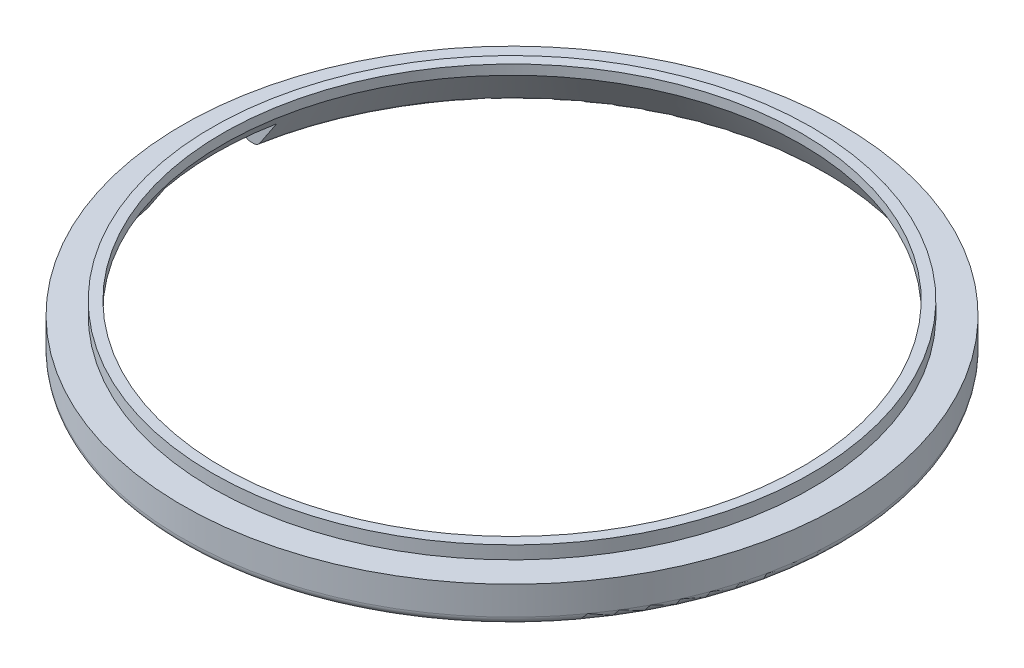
ISO-10303-21;
HEADER;
FILE_DESCRIPTION(('STEP AP214'),'2;1');
FILE_NAME('part.step','',(''),(''),'','','');
FILE_SCHEMA(('AUTOMOTIVE_DESIGN { 1 0 10303 214 1 1 1 1 }'));
ENDSEC;
DATA;
#1=APPLICATION_CONTEXT('core data for automotive mechanical design processes');
#2=APPLICATION_PROTOCOL_DEFINITION('international standard','automotive_design',2000,#1);
#3=PRODUCT_CONTEXT('',#1,'mechanical');
#4=PRODUCT('Part','Part','',(#3));
#5=PRODUCT_RELATED_PRODUCT_CATEGORY('part','',(#4));
#6=PRODUCT_DEFINITION_FORMATION('','',#4);
#7=PRODUCT_DEFINITION_CONTEXT('part definition',#1,'design');
#8=PRODUCT_DEFINITION('design','',#6,#7);
#9=PRODUCT_DEFINITION_SHAPE('','',#8);
#10=(LENGTH_UNIT() NAMED_UNIT(*) SI_UNIT(.MILLI.,.METRE.));
#11=(NAMED_UNIT(*) PLANE_ANGLE_UNIT() SI_UNIT($,.RADIAN.));
#12=(NAMED_UNIT(*) SI_UNIT($,.STERADIAN.) SOLID_ANGLE_UNIT());
#13=UNCERTAINTY_MEASURE_WITH_UNIT(LENGTH_MEASURE(1.E-05),#10,'distance_accuracy_value','');
#14=(GEOMETRIC_REPRESENTATION_CONTEXT(3) GLOBAL_UNCERTAINTY_ASSIGNED_CONTEXT((#13)) GLOBAL_UNIT_ASSIGNED_CONTEXT((#10,
#11,#12)) REPRESENTATION_CONTEXT('',''));
#15=CARTESIAN_POINT('',(0.,0.,0.));
#16=DIRECTION('',(0.,0.,1.));
#17=DIRECTION('',(1.,0.,0.));
#18=AXIS2_PLACEMENT_3D('',#15,#16,#17);
#19=CARTESIAN_POINT('',(0.,1.9,0.));
#20=DIRECTION('',(0.,1.,0.));
#21=DIRECTION('',(0.,0.,1.));
#22=AXIS2_PLACEMENT_3D('',#19,#20,#21);
#23=PLANE('',#22);
#24=CARTESIAN_POINT('',(0.,1.9,0.));
#25=DIRECTION('',(0.,1.,0.));
#26=DIRECTION('',(0.,0.,1.));
#27=AXIS2_PLACEMENT_3D('',#24,#25,#26);
#28=CIRCLE('',#27,11.15);
#29=CARTESIAN_POINT('',(0.,1.9,-11.15));
#30=VERTEX_POINT('',#29);
#31=EDGE_CURVE('E236',#30,#30,#28,.T.);
#32=ORIENTED_EDGE('',*,*,#31,.F.);
#33=EDGE_LOOP('',(#32));
#34=FACE_BOUND('',#33,.T.);
#35=CARTESIAN_POINT('',(0.,1.9,0.));
#36=DIRECTION('',(0.,1.,0.));
#37=DIRECTION('',(0.,0.,1.));
#38=AXIS2_PLACEMENT_3D('',#35,#36,#37);
#39=CIRCLE('',#38,11.55);
#40=CARTESIAN_POINT('',(0.,1.9,11.55));
#41=VERTEX_POINT('',#40);
#42=EDGE_CURVE('E251',#41,#41,#39,.T.);
#43=ORIENTED_EDGE('',*,*,#42,.T.);
#44=EDGE_LOOP('',(#43));
#45=FACE_BOUND('',#44,.T.);
#46=ADVANCED_FACE('F34',(#34,#45),#23,.T.);
#47=CARTESIAN_POINT('',(0.,1.9,0.));
#48=DIRECTION('',(0.,-1.,0.));
#49=DIRECTION('',(0.,0.,-1.));
#50=AXIS2_PLACEMENT_3D('',#47,#48,#49);
#51=CYLINDRICAL_SURFACE('',#50,12.7);
#52=CARTESIAN_POINT('',(0.,1.4,0.));
#53=DIRECTION('',(0.,1.,0.));
#54=DIRECTION('',(0.,0.,1.));
#55=AXIS2_PLACEMENT_3D('',#52,#53,#54);
#56=CIRCLE('',#55,12.7);
#57=CARTESIAN_POINT('',(-12.516688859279,1.4,2.15));
#58=VERTEX_POINT('',#57);
#59=CARTESIAN_POINT('',(-12.516688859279,1.4,-2.15));
#60=VERTEX_POINT('',#59);
#61=EDGE_CURVE('E102',#58,#60,#56,.T.);
#62=ORIENTED_EDGE('',*,*,#61,.F.);
#63=DIRECTION('',(0.,-1.,0.));
#64=VECTOR('',#63,1.);
#65=CARTESIAN_POINT('',(-12.516688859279,1.9,2.15));
#66=LINE('',#65,#64);
#67=CARTESIAN_POINT('',(-12.516688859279,0.3,2.15));
#68=VERTEX_POINT('',#67);
#69=EDGE_CURVE('E115',#58,#68,#66,.T.);
#70=ORIENTED_EDGE('',*,*,#69,.T.);
#71=CARTESIAN_POINT('',(0.,0.3,0.));
#72=DIRECTION('',(0.,1.,0.));
#73=DIRECTION('',(0.,0.,1.));
#74=AXIS2_PLACEMENT_3D('',#71,#72,#73);
#75=CIRCLE('',#74,12.7);
#76=CARTESIAN_POINT('',(-12.516688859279,0.3,-2.15));
#77=VERTEX_POINT('',#76);
#78=EDGE_CURVE('E108',#68,#77,#75,.T.);
#79=ORIENTED_EDGE('',*,*,#78,.T.);
#80=DIRECTION('',(0.,-1.,0.));
#81=VECTOR('',#80,1.);
#82=CARTESIAN_POINT('',(-12.516688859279,1.9,-2.15));
#83=LINE('',#82,#81);
#84=EDGE_CURVE('E118',#77,#60,#83,.F.);
#85=ORIENTED_EDGE('',*,*,#84,.T.);
#86=EDGE_LOOP('',(#62,#70,#79,#85));
#87=FACE_BOUND('',#86,.T.);
#88=ADVANCED_FACE('F113',(#87),#51,.T.);
#89=CARTESIAN_POINT('',(0.,0.,0.));
#90=DIRECTION('',(0.,1.,0.));
#91=DIRECTION('',(0.,0.,1.));
#92=AXIS2_PLACEMENT_3D('',#89,#90,#91);
#93=PLANE('',#92);
#94=DIRECTION('',(1.,0.,0.));
#95=VECTOR('',#94,1.);
#96=CARTESIAN_POINT('',(-12.7,0.,-2.15));
#97=LINE('',#96,#95);
#98=CARTESIAN_POINT('',(-12.212186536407,0.,-2.15));
#99=VERTEX_POINT('',#98);
#100=CARTESIAN_POINT('',(-12.1228641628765,0.,-2.15));
#101=VERTEX_POINT('',#100);
#102=EDGE_CURVE('E126',#99,#101,#97,.T.);
#103=ORIENTED_EDGE('',*,*,#102,.F.);
#104=CARTESIAN_POINT('',(0.,0.,0.));
#105=DIRECTION('',(0.,1.,0.));
#106=DIRECTION('',(0.,0.,1.));
#107=AXIS2_PLACEMENT_3D('',#104,#105,#106);
#108=CIRCLE('',#107,12.4);
#109=CARTESIAN_POINT('',(-12.212186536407,0.,2.15));
#110=VERTEX_POINT('',#109);
#111=EDGE_CURVE('E166',#99,#110,#108,.F.);
#112=ORIENTED_EDGE('',*,*,#111,.T.);
#113=DIRECTION('',(1.,0.,0.));
#114=VECTOR('',#113,1.);
#115=CARTESIAN_POINT('',(-12.7,0.,2.15));
#116=LINE('',#115,#114);
#117=CARTESIAN_POINT('',(-12.1228641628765,0.,2.15));
#118=VERTEX_POINT('',#117);
#119=EDGE_CURVE('E232',#110,#118,#116,.T.);
#120=ORIENTED_EDGE('',*,*,#119,.T.);
#121=CARTESIAN_POINT('',(0.,0.,0.));
#122=DIRECTION('',(0.,1.,0.));
#123=DIRECTION('',(0.,0.,1.));
#124=AXIS2_PLACEMENT_3D('',#121,#122,#123);
#125=CIRCLE('',#124,12.312040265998);
#126=EDGE_CURVE('E167',#118,#101,#125,.T.);
#127=ORIENTED_EDGE('',*,*,#126,.T.);
#128=EDGE_LOOP('',(#103,#112,#120,#127));
#129=FACE_BOUND('',#128,.T.);
#130=ADVANCED_FACE('F223',(#129),#93,.F.);
#131=CARTESIAN_POINT('',(0.,1.9,0.));
#132=DIRECTION('',(0.,-1.,0.));
#133=DIRECTION('',(0.,0.,-1.));
#134=AXIS2_PLACEMENT_3D('',#131,#132,#133);
#135=CYLINDRICAL_SURFACE('',#134,11.15);
#136=CARTESIAN_POINT('',(0.,1.52525347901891,0.));
#137=DIRECTION('',(0.,-1.,0.));
#138=DIRECTION('',(0.,0.,-1.));
#139=AXIS2_PLACEMENT_3D('',#136,#137,#138);
#140=CIRCLE('',#139,11.15);
#141=CARTESIAN_POINT('',(0.,1.52525347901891,-11.15));
#142=VERTEX_POINT('',#141);
#143=EDGE_CURVE('E119',#142,#142,#140,.T.);
#144=CARTESIAN_POINT('',(0.,1.52525347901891,-11.15));
#145=CARTESIAN_POINT('',(0.,1.52915708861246,-11.15));
#146=CARTESIAN_POINT('',(0.,1.53306069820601,-11.15));
#147=CARTESIAN_POINT('',(0.,1.54086791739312,-11.15));
#148=CARTESIAN_POINT('',(0.,1.54477152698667,-11.15));
#149=CARTESIAN_POINT('',(0.,1.55257874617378,-11.15));
#150=CARTESIAN_POINT('',(0.,1.55648235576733,-11.15));
#151=CARTESIAN_POINT('',(0.,1.56428957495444,-11.15));
#152=CARTESIAN_POINT('',(0.,1.56819318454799,-11.15));
#153=CARTESIAN_POINT('',(0.,1.5760004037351,-11.15));
#154=CARTESIAN_POINT('',(0.,1.57990401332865,-11.15));
#155=CARTESIAN_POINT('',(0.,1.58771123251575,-11.15));
#156=CARTESIAN_POINT('',(0.,1.59161484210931,-11.15));
#157=CARTESIAN_POINT('',(0.,1.59942206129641,-11.15));
#158=CARTESIAN_POINT('',(0.,1.60332567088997,-11.15));
#159=CARTESIAN_POINT('',(0.,1.61113289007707,-11.15));
#160=CARTESIAN_POINT('',(0.,1.61503649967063,-11.15));
#161=CARTESIAN_POINT('',(0.,1.62284371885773,-11.15));
#162=CARTESIAN_POINT('',(0.,1.62674732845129,-11.15));
#163=CARTESIAN_POINT('',(0.,1.63455454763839,-11.15));
#164=CARTESIAN_POINT('',(0.,1.63845815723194,-11.15));
#165=CARTESIAN_POINT('',(0.,1.64626537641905,-11.15));
#166=CARTESIAN_POINT('',(0.,1.6501689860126,-11.15));
#167=CARTESIAN_POINT('',(0.,1.65797620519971,-11.15));
#168=CARTESIAN_POINT('',(0.,1.66187981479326,-11.15));
#169=CARTESIAN_POINT('',(0.,1.66968703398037,-11.15));
#170=CARTESIAN_POINT('',(0.,1.67359064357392,-11.15));
#171=CARTESIAN_POINT('',(0.,1.68139786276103,-11.15));
#172=CARTESIAN_POINT('',(0.,1.68530147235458,-11.15));
#173=CARTESIAN_POINT('',(0.,1.69310869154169,-11.15));
#174=CARTESIAN_POINT('',(0.,1.69701230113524,-11.15));
#175=CARTESIAN_POINT('',(0.,1.70481952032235,-11.15));
#176=CARTESIAN_POINT('',(0.,1.7087231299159,-11.15));
#177=CARTESIAN_POINT('',(0.,1.71653034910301,-11.15));
#178=CARTESIAN_POINT('',(0.,1.72043395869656,-11.15));
#179=CARTESIAN_POINT('',(0.,1.72824117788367,-11.15));
#180=CARTESIAN_POINT('',(0.,1.73214478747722,-11.15));
#181=CARTESIAN_POINT('',(0.,1.73995200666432,-11.15));
#182=CARTESIAN_POINT('',(0.,1.74385561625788,-11.15));
#183=CARTESIAN_POINT('',(0.,1.75166283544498,-11.15));
#184=CARTESIAN_POINT('',(0.,1.75556644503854,-11.15));
#185=CARTESIAN_POINT('',(0.,1.76337366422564,-11.15));
#186=CARTESIAN_POINT('',(0.,1.7672772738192,-11.15));
#187=CARTESIAN_POINT('',(0.,1.7750844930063,-11.15));
#188=CARTESIAN_POINT('',(0.,1.77898810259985,-11.15));
#189=CARTESIAN_POINT('',(0.,1.78679532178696,-11.15));
#190=CARTESIAN_POINT('',(0.,1.79069893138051,-11.15));
#191=CARTESIAN_POINT('',(0.,1.79850615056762,-11.15));
#192=CARTESIAN_POINT('',(0.,1.80240976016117,-11.15));
#193=CARTESIAN_POINT('',(0.,1.81021697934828,-11.15));
#194=CARTESIAN_POINT('',(0.,1.81412058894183,-11.15));
#195=CARTESIAN_POINT('',(0.,1.82192780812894,-11.15));
#196=CARTESIAN_POINT('',(0.,1.82583141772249,-11.15));
#197=CARTESIAN_POINT('',(0.,1.8336386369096,-11.15));
#198=CARTESIAN_POINT('',(0.,1.83754224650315,-11.15));
#199=CARTESIAN_POINT('',(0.,1.84534946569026,-11.15));
#200=CARTESIAN_POINT('',(0.,1.84925307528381,-11.15));
#201=CARTESIAN_POINT('',(0.,1.85706029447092,-11.15));
#202=CARTESIAN_POINT('',(0.,1.86096390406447,-11.15));
#203=CARTESIAN_POINT('',(0.,1.86877112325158,-11.15));
#204=CARTESIAN_POINT('',(0.,1.87267473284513,-11.15));
#205=CARTESIAN_POINT('',(0.,1.88048195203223,-11.15));
#206=CARTESIAN_POINT('',(0.,1.88438556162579,-11.15));
#207=CARTESIAN_POINT('',(0.,1.89219278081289,-11.15));
#208=CARTESIAN_POINT('',(0.,1.89609639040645,-11.15));
#209=CARTESIAN_POINT('',(0.,1.9,-11.15));
#210=B_SPLINE_CURVE_WITH_KNOTS('',3,(#144,#145,#146,#147,#148,#149,#150,#151,#152,#153,#154,
#155,#156,#157,#158,#159,#160,#161,#162,#163,#164,#165,#166,#167,#168,#169,#170,#171,#172,#173,
#174,#175,#176,#177,#178,#179,#180,#181,#182,#183,#184,#185,#186,#187,#188,#189,#190,#191,#192,
#193,#194,#195,#196,#197,#198,#199,#200,#201,#202,#203,#204,#205,#206,#207,#208,#209),
.UNSPECIFIED.,.F.,.F.,(4,2,2,2,2,2,2,2,2,2,2,2,2,2,2,2,2,2,2,2,2,2,2,2,2,2,2,2,2,2,2,2,4),(0.,
0.0117108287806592,0.0234216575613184,0.0351324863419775,0.0468433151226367,0.0585541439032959,
0.0702649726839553,0.0819758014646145,0.0936866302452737,0.105397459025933,0.117108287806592,
0.128819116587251,0.14052994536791,0.15224077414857,0.163951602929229,0.175662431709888,
0.187373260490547,0.199084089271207,0.210794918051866,0.222505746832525,0.234216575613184,
0.245927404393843,0.257638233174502,0.269349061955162,0.281059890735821,0.29277071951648,
0.304481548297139,0.316192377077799,0.327903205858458,0.339614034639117,0.351324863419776,
0.363035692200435,0.374746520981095),.UNSPECIFIED.);
#211=EDGE_CURVE('BSEAM183',#142,#30,#210,.T.);
#212=ORIENTED_EDGE('',*,*,#143,.T.);
#213=ORIENTED_EDGE('',*,*,#31,.T.);
#214=ORIENTED_EDGE('',*,*,#211,.T.);
#215=ORIENTED_EDGE('',*,*,#211,.F.);
#216=EDGE_LOOP('',(#212,#214,#213,#215));
#217=FACE_BOUND('',#216,.T.);
#218=ADVANCED_FACE('F183',(#217),#135,.F.);
#219=CARTESIAN_POINT('',(-12.7,0.,-2.15));
#220=DIRECTION('',(0.,0.,-1.));
#221=DIRECTION('',(0.,1.,0.));
#222=AXIS2_PLACEMENT_3D('',#219,#220,#221);
#223=PLANE('',#222);
#224=ORIENTED_EDGE('',*,*,#84,.F.);
#225=CARTESIAN_POINT('',(-12.516688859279,0.3,-2.15));
#226=CARTESIAN_POINT('',(-12.516704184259,0.283300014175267,-2.15));
#227=CARTESIAN_POINT('',(-12.51527494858,0.266605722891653,-2.15));
#228=CARTESIAN_POINT('',(-12.5096421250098,0.233711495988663,-2.15));
#229=CARTESIAN_POINT('',(-12.5054418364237,0.217510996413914,-2.15));
#230=CARTESIAN_POINT('',(-12.4943792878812,0.186040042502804,-2.15));
#231=CARTESIAN_POINT('',(-12.4875161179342,0.170769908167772,-2.15));
#232=CARTESIAN_POINT('',(-12.4713406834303,0.141589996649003,-2.15));
#233=CARTESIAN_POINT('',(-12.4620285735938,0.127680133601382,-2.15));
#234=CARTESIAN_POINT('',(-12.4411637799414,0.101515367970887,-2.15));
#235=CARTESIAN_POINT('',(-12.4295975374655,0.0892712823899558,-2.15));
#236=CARTESIAN_POINT('',(-12.4045962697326,0.0668646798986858,-2.15));
#237=CARTESIAN_POINT('',(-12.3911608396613,0.0567026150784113,-2.15));
#238=CARTESIAN_POINT('',(-12.3626072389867,0.0386007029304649,-2.15));
#239=CARTESIAN_POINT('',(-12.3474683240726,0.0306936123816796,-2.15));
#240=CARTESIAN_POINT('',(-12.3160921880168,0.0174974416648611,-2.15));
#241=CARTESIAN_POINT('',(-12.2998553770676,0.0122073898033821,-2.15));
#242=CARTESIAN_POINT('',(-12.2716532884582,0.00553607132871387,-2.15));
#243=CARTESIAN_POINT('',(-12.2598470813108,0.00346117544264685,-2.15));
#244=CARTESIAN_POINT('',(-12.2360908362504,0.000693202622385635,-2.15));
#245=CARTESIAN_POINT('',(-12.224141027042,-1.83742113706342E-06,-2.15));
#246=CARTESIAN_POINT('',(-12.212186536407,0.,-2.15));
#247=B_SPLINE_CURVE_WITH_KNOTS('',3,(#225,#226,#227,#228,#229,#230,#231,#232,#233,#234,#235,
#236,#237,#238,#239,#240,#241,#242,#243,#244,#245,#246),.UNSPECIFIED.,.F.,.F.,(4,2,2,2,2,2,2,2,
2,2,4),(0.,0.0500304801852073,0.10000149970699,0.149989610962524,0.199974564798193,
0.250270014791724,0.300576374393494,0.351580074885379,0.40256482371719,0.438450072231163,
0.474284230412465),.UNSPECIFIED.);
#248=EDGE_CURVE('E152',#77,#99,#247,.T.);
#249=ORIENTED_EDGE('',*,*,#248,.T.);
#250=ORIENTED_EDGE('',*,*,#102,.T.);
#251=CARTESIAN_POINT('',(-12.1228641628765,0.,-2.15));
#252=CARTESIAN_POINT('',(-12.1055158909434,-1.3442783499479E-05,-2.15));
#253=CARTESIAN_POINT('',(-12.0881703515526,0.00145816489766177,-2.15));
#254=CARTESIAN_POINT('',(-12.0539781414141,0.0072722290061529,-2.15));
#255=CARTESIAN_POINT('',(-12.0371311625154,0.0116128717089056,-2.15));
#256=CARTESIAN_POINT('',(-12.0043912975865,0.0230712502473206,-2.15));
#257=CARTESIAN_POINT('',(-11.9884993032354,0.0301915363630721,-2.15));
#258=CARTESIAN_POINT('',(-11.9581547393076,0.0470129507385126,-2.15));
#259=CARTESIAN_POINT('',(-11.9437013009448,0.056712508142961,-2.15));
#260=CARTESIAN_POINT('',(-11.9181712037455,0.0772170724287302,-2.15));
#261=CARTESIAN_POINT('',(-11.9068977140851,0.0877780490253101,-2.15));
#262=CARTESIAN_POINT('',(-11.8860743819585,0.110503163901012,-2.15));
#263=CARTESIAN_POINT('',(-11.8765266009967,0.122669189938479,-2.15));
#264=CARTESIAN_POINT('',(-11.8679798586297,0.135512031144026,-2.15));
#265=B_SPLINE_CURVE_WITH_KNOTS('',3,(#251,#252,#253,#254,#255,#256,#257,#258,#259,#260,#261,
#262,#263,#264),.UNSPECIFIED.,.F.,.F.,(4,2,2,2,2,2,4),(0.,0.051979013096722,0.103925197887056,
0.155919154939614,0.207881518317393,0.25404713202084,0.300267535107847),.UNSPECIFIED.);
#266=CARTESIAN_POINT('',(-11.8679798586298,0.13551203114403,-2.15));
#267=VERTEX_POINT('',#266);
#268=EDGE_CURVE('E171',#101,#267,#265,.T.);
#269=ORIENTED_EDGE('',*,*,#268,.T.);
#270=CARTESIAN_POINT('',(-13.5695185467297,-2.42330652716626,-2.15));
#271=CARTESIAN_POINT('',(-13.2928045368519,-2.00645330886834,-2.15));
#272=CARTESIAN_POINT('',(-13.0159518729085,-1.58969205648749,-2.15));
#273=CARTESIAN_POINT('',(-12.4618982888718,-0.756401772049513,-2.15));
#274=CARTESIAN_POINT('',(-12.1846973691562,-0.339872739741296,-2.15));
#275=CARTESIAN_POINT('',(-11.6298756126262,0.492905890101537,-2.15));
#276=CARTESIAN_POINT('',(-11.3522547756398,0.909155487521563,-2.15));
#277=CARTESIAN_POINT('',(-10.7964844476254,1.74130222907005,-2.15));
#278=CARTESIAN_POINT('',(-10.5183349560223,2.15719937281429,-2.15));
#279=CARTESIAN_POINT('',(-10.2398670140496,2.57288341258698,-2.15));
#280=B_SPLINE_CURVE_WITH_KNOTS('',3,(#270,#271,#272,#273,#274,#275,#276,#277,#278,#279),
.UNSPECIFIED.,.F.,.F.,(4,2,2,2,4),(0.,1.50101146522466,3.00202130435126,4.50303175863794,
6.00404384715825),.UNSPECIFIED.);
#281=CARTESIAN_POINT('',(-11.2247566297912,1.1,-2.15));
#282=VERTEX_POINT('',#281);
#283=EDGE_CURVE('E189',#267,#282,#280,.T.);
#284=ORIENTED_EDGE('',*,*,#283,.T.);
#285=DIRECTION('',(1.,0.,0.));
#286=VECTOR('',#285,1.);
#287=CARTESIAN_POINT('',(-12.7,1.1,-2.15));
#288=LINE('',#287,#286);
#289=CARTESIAN_POINT('',(-12.212186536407,1.1,-2.15));
#290=VERTEX_POINT('',#289);
#291=EDGE_CURVE('E196',#290,#282,#288,.T.);
#292=ORIENTED_EDGE('',*,*,#291,.F.);
#293=CARTESIAN_POINT('',(-12.212186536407,1.1,-2.15));
#294=CARTESIAN_POINT('',(-12.2295086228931,1.09998650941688,-2.15));
#295=CARTESIAN_POINT('',(-12.2468281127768,1.10145441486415,-2.15));
#296=CARTESIAN_POINT('',(-12.2809746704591,1.10725666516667,-2.15));
#297=CARTESIAN_POINT('',(-12.2978018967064,1.11159007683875,-2.15));
#298=CARTESIAN_POINT('',(-12.3304991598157,1.12303079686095,-2.15));
#299=CARTESIAN_POINT('',(-12.3463685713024,1.1301398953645,-2.15));
#300=CARTESIAN_POINT('',(-12.3766724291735,1.14693780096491,-2.15));
#301=CARTESIAN_POINT('',(-12.3911073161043,1.15662581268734,-2.15));
#302=CARTESIAN_POINT('',(-12.4180177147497,1.17824052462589,-2.15));
#303=CARTESIAN_POINT('',(-12.4305067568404,1.19015037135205,-2.15));
#304=CARTESIAN_POINT('',(-12.4532757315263,1.21592791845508,-2.15));
#305=CARTESIAN_POINT('',(-12.4635552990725,1.22979594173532,-2.15));
#306=CARTESIAN_POINT('',(-12.4814553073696,1.25888345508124,-2.15));
#307=CARTESIAN_POINT('',(-12.4891109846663,1.27408128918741,-2.15));
#308=CARTESIAN_POINT('',(-12.5017191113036,1.30555394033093,-2.15));
#309=CARTESIAN_POINT('',(-12.5066737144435,1.32182788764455,-2.15));
#310=CARTESIAN_POINT('',(-12.5123578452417,1.34851963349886,-2.15));
#311=CARTESIAN_POINT('',(-12.5139810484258,1.35875550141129,-2.15));
#312=CARTESIAN_POINT('',(-12.5161462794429,1.37932600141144,-2.15));
#313=CARTESIAN_POINT('',(-12.5166898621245,1.38966046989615,-2.15));
#314=CARTESIAN_POINT('',(-12.5166888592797,1.39999999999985,-2.15));
#315=B_SPLINE_CURVE_WITH_KNOTS('',3,(#293,#294,#295,#296,#297,#298,#299,#300,#301,#302,#303,
#304,#305,#306,#307,#308,#309,#310,#311,#312,#313,#314),.UNSPECIFIED.,.F.,.F.,(4,2,2,2,2,2,2,2,
2,2,4),(0.,0.0519007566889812,0.103784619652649,0.155702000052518,0.207603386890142,
0.259126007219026,0.31065713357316,0.361466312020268,0.412234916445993,0.443274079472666,
0.47426850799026),.UNSPECIFIED.);
#316=EDGE_CURVE('E12',#290,#60,#315,.T.);
#317=ORIENTED_EDGE('',*,*,#316,.T.);
#318=EDGE_LOOP('',(#224,#249,#250,#269,#284,#292,#317));
#319=FACE_BOUND('',#318,.T.);
#320=ADVANCED_FACE('F179',(#319),#223,.F.);
#321=CARTESIAN_POINT('',(-12.7,0.,2.15));
#322=DIRECTION('',(0.,0.,1.));
#323=DIRECTION('',(0.,-1.,0.));
#324=AXIS2_PLACEMENT_3D('',#321,#322,#323);
#325=PLANE('',#324);
#326=ORIENTED_EDGE('',*,*,#119,.F.);
#327=CARTESIAN_POINT('',(-12.212186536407,0.,2.15));
#328=CARTESIAN_POINT('',(-12.2295086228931,-1.3490583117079E-05,2.15));
#329=CARTESIAN_POINT('',(-12.2468281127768,0.00145441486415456,2.15));
#330=CARTESIAN_POINT('',(-12.2809746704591,0.00725666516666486,2.15));
#331=CARTESIAN_POINT('',(-12.2978018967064,0.0115900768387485,2.15));
#332=CARTESIAN_POINT('',(-12.3304991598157,0.0230307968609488,2.15));
#333=CARTESIAN_POINT('',(-12.3463685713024,0.0301398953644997,2.15));
#334=CARTESIAN_POINT('',(-12.3766724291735,0.0469378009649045,2.15));
#335=CARTESIAN_POINT('',(-12.3911073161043,0.0566258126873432,2.15));
#336=CARTESIAN_POINT('',(-12.4180177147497,0.0782405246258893,2.15));
#337=CARTESIAN_POINT('',(-12.4305067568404,0.0901503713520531,2.15));
#338=CARTESIAN_POINT('',(-12.4532757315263,0.115927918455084,2.15));
#339=CARTESIAN_POINT('',(-12.4635552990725,0.129795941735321,2.15));
#340=CARTESIAN_POINT('',(-12.4814553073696,0.158883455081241,2.15));
#341=CARTESIAN_POINT('',(-12.4891109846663,0.174081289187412,2.15));
#342=CARTESIAN_POINT('',(-12.5017191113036,0.205553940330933,2.15));
#343=CARTESIAN_POINT('',(-12.5066737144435,0.221827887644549,2.15));
#344=CARTESIAN_POINT('',(-12.5123578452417,0.24851963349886,2.15));
#345=CARTESIAN_POINT('',(-12.5139810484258,0.258755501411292,2.15));
#346=CARTESIAN_POINT('',(-12.5161462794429,0.279326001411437,2.15));
#347=CARTESIAN_POINT('',(-12.5166898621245,0.289660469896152,2.15));
#348=CARTESIAN_POINT('',(-12.5166888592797,0.29999999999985,2.15));
#349=B_SPLINE_CURVE_WITH_KNOTS('',3,(#327,#328,#329,#330,#331,#332,#333,#334,#335,#336,#337,
#338,#339,#340,#341,#342,#343,#344,#345,#346,#347,#348),.UNSPECIFIED.,.F.,.F.,(4,2,2,2,2,2,2,2,
2,2,4),(0.,0.0519007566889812,0.103784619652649,0.155702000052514,0.207603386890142,
0.259126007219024,0.31065713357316,0.361466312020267,0.412234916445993,0.443274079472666,
0.47426850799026),.UNSPECIFIED.);
#350=EDGE_CURVE('E125',#110,#68,#349,.T.);
#351=ORIENTED_EDGE('',*,*,#350,.T.);
#352=ORIENTED_EDGE('',*,*,#69,.F.);
#353=CARTESIAN_POINT('',(-12.516688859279,1.4,2.15));
#354=CARTESIAN_POINT('',(-12.516704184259,1.38330001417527,2.15));
#355=CARTESIAN_POINT('',(-12.51527494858,1.36660572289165,2.15));
#356=CARTESIAN_POINT('',(-12.5096421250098,1.33371149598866,2.15));
#357=CARTESIAN_POINT('',(-12.5054418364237,1.31751099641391,2.15));
#358=CARTESIAN_POINT('',(-12.4943792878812,1.2860400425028,2.15));
#359=CARTESIAN_POINT('',(-12.4875161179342,1.27076990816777,2.15));
#360=CARTESIAN_POINT('',(-12.4713406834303,1.241589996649,2.15));
#361=CARTESIAN_POINT('',(-12.4620285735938,1.22768013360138,2.15));
#362=CARTESIAN_POINT('',(-12.4411637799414,1.20151536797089,2.15));
#363=CARTESIAN_POINT('',(-12.4295975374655,1.18927128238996,2.15));
#364=CARTESIAN_POINT('',(-12.4045962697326,1.16686467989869,2.15));
#365=CARTESIAN_POINT('',(-12.3911608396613,1.15670261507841,2.15));
#366=CARTESIAN_POINT('',(-12.3626072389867,1.13860070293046,2.15));
#367=CARTESIAN_POINT('',(-12.3474683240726,1.13069361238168,2.15));
#368=CARTESIAN_POINT('',(-12.3160921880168,1.11749744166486,2.15));
#369=CARTESIAN_POINT('',(-12.2998553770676,1.11220738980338,2.15));
#370=CARTESIAN_POINT('',(-12.2716532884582,1.10553607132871,2.15));
#371=CARTESIAN_POINT('',(-12.2598470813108,1.10346117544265,2.15));
#372=CARTESIAN_POINT('',(-12.2360908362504,1.10069320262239,2.15));
#373=CARTESIAN_POINT('',(-12.224141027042,1.09999816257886,2.15));
#374=CARTESIAN_POINT('',(-12.212186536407,1.1,2.15));
#375=B_SPLINE_CURVE_WITH_KNOTS('',3,(#353,#354,#355,#356,#357,#358,#359,#360,#361,#362,#363,
#364,#365,#366,#367,#368,#369,#370,#371,#372,#373,#374),.UNSPECIFIED.,.F.,.F.,(4,2,2,2,2,2,2,2,
2,2,4),(0.,0.0500304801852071,0.100001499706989,0.149989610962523,0.199974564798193,
0.250270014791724,0.300576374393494,0.351580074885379,0.402564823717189,0.438450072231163,
0.474284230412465),.UNSPECIFIED.);
#376=CARTESIAN_POINT('',(-12.212186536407,1.1,2.15));
#377=VERTEX_POINT('',#376);
#378=EDGE_CURVE('E48',#58,#377,#375,.T.);
#379=ORIENTED_EDGE('',*,*,#378,.T.);
#380=DIRECTION('',(1.,0.,0.));
#381=VECTOR('',#380,1.);
#382=CARTESIAN_POINT('',(-12.7,1.1,2.15));
#383=LINE('',#382,#381);
#384=CARTESIAN_POINT('',(-11.2247566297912,1.1,2.15));
#385=VERTEX_POINT('',#384);
#386=EDGE_CURVE('E244',#377,#385,#383,.T.);
#387=ORIENTED_EDGE('',*,*,#386,.T.);
#388=CARTESIAN_POINT('',(-10.2398670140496,2.57288341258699,2.15));
#389=CARTESIAN_POINT('',(-10.5183349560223,2.15719937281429,2.15));
#390=CARTESIAN_POINT('',(-10.7964844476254,1.74130222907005,2.15));
#391=CARTESIAN_POINT('',(-11.3522547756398,0.909155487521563,2.15));
#392=CARTESIAN_POINT('',(-11.6298756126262,0.492905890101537,2.15));
#393=CARTESIAN_POINT('',(-12.1846973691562,-0.339872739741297,2.15));
#394=CARTESIAN_POINT('',(-12.4618982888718,-0.756401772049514,2.15));
#395=CARTESIAN_POINT('',(-13.0159518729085,-1.5896920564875,2.15));
#396=CARTESIAN_POINT('',(-13.2928045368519,-2.00645330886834,2.15));
#397=CARTESIAN_POINT('',(-13.5695185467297,-2.42330652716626,2.15));
#398=B_SPLINE_CURVE_WITH_KNOTS('',3,(#388,#389,#390,#391,#392,#393,#394,#395,#396,#397),
.UNSPECIFIED.,.F.,.F.,(4,2,2,2,4),(0.,1.50101208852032,3.002022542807,4.5030323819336,
6.00404384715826),.UNSPECIFIED.);
#399=CARTESIAN_POINT('',(-11.8679798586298,0.135512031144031,2.15));
#400=VERTEX_POINT('',#399);
#401=EDGE_CURVE('E197',#385,#400,#398,.T.);
#402=ORIENTED_EDGE('',*,*,#401,.T.);
#403=CARTESIAN_POINT('',(-11.8679798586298,0.135512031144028,2.15000000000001));
#404=CARTESIAN_POINT('',(-11.8774356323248,0.121294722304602,2.15));
#405=CARTESIAN_POINT('',(-11.8881241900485,0.107909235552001,2.15));
#406=CARTESIAN_POINT('',(-11.9115747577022,0.08314757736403,2.15));
#407=CARTESIAN_POINT('',(-11.9243325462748,0.0717674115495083,2.15));
#408=CARTESIAN_POINT('',(-11.9515753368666,0.0512985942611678,2.15));
#409=CARTESIAN_POINT('',(-11.9660609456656,0.0422107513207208,2.15));
#410=CARTESIAN_POINT('',(-11.9963415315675,0.0265620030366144,2.15));
#411=CARTESIAN_POINT('',(-12.0121367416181,0.0200015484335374,2.15));
#412=CARTESIAN_POINT('',(-12.0436011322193,0.00989858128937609,2.15));
#413=CARTESIAN_POINT('',(-12.0592194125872,0.00619661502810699,2.15));
#414=CARTESIAN_POINT('',(-12.0908452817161,0.00124232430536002,2.15));
#415=CARTESIAN_POINT('',(-12.1068530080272,-9.12154720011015E-06,2.15));
#416=CARTESIAN_POINT('',(-12.1228641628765,0.,2.15));
#417=B_SPLINE_CURVE_WITH_KNOTS('',3,(#403,#404,#405,#406,#407,#408,#409,#410,#411,#412,#413,
#414,#415,#416),.UNSPECIFIED.,.F.,.F.,(4,2,2,2,2,2,4),(0.,0.0511479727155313,0.102192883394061,
0.153255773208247,0.204327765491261,0.252289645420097,0.300268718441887),.UNSPECIFIED.);
#418=EDGE_CURVE('E55',#400,#118,#417,.T.);
#419=ORIENTED_EDGE('',*,*,#418,.T.);
#420=EDGE_LOOP('',(#326,#351,#352,#379,#387,#402,#419));
#421=FACE_BOUND('',#420,.T.);
#422=ADVANCED_FACE('F122',(#421),#325,.F.);
#423=CARTESIAN_POINT('',(-12.7,1.1,-2.15));
#424=DIRECTION('',(0.,1.,0.));
#425=DIRECTION('',(0.,0.,1.));
#426=AXIS2_PLACEMENT_3D('',#423,#424,#425);
#427=PLANE('',#426);
#428=ORIENTED_EDGE('',*,*,#386,.F.);
#429=CARTESIAN_POINT('',(0.,1.1,0.));
#430=DIRECTION('',(0.,1.,0.));
#431=DIRECTION('',(0.,0.,1.));
#432=AXIS2_PLACEMENT_3D('',#429,#430,#431);
#433=CIRCLE('',#432,12.4);
#434=EDGE_CURVE('E107',#377,#290,#433,.F.);
#435=ORIENTED_EDGE('',*,*,#434,.T.);
#436=ORIENTED_EDGE('',*,*,#291,.T.);
#437=CARTESIAN_POINT('',(0.,1.1,0.));
#438=DIRECTION('',(0.,1.,0.));
#439=DIRECTION('',(0.,0.,1.));
#440=AXIS2_PLACEMENT_3D('',#437,#438,#439);
#441=CIRCLE('',#440,11.4288083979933);
#442=EDGE_CURVE('E233',#282,#385,#441,.T.);
#443=ORIENTED_EDGE('',*,*,#442,.T.);
#444=EDGE_LOOP('',(#428,#435,#436,#443));
#445=FACE_BOUND('',#444,.T.);
#446=ADVANCED_FACE('F184',(#445),#427,.F.);
#447=CARTESIAN_POINT('',(0.,0.,0.));
#448=DIRECTION('',(0.,-1.,0.));
#449=DIRECTION('',(0.,0.,-1.));
#450=AXIS2_PLACEMENT_3D('',#447,#448,#449);
#451=CONICAL_SURFACE('',#450,12.15,0.580321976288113);
#452=ORIENTED_EDGE('',*,*,#143,.F.);
#453=EDGE_LOOP('',(#452));
#454=FACE_BOUND('',#453,.T.);
#455=ORIENTED_EDGE('',*,*,#283,.F.);
#456=CARTESIAN_POINT('',(0.,0.135512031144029,0.));
#457=DIRECTION('',(0.,1.,0.));
#458=DIRECTION('',(0.,0.,1.));
#459=AXIS2_PLACEMENT_3D('',#456,#457,#458);
#460=CIRCLE('',#459,12.0611544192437);
#461=EDGE_CURVE('E130',#267,#400,#460,.F.);
#462=ORIENTED_EDGE('',*,*,#461,.T.);
#463=ORIENTED_EDGE('',*,*,#401,.F.);
#464=ORIENTED_EDGE('',*,*,#442,.F.);
#465=EDGE_LOOP('',(#455,#462,#463,#464));
#466=FACE_BOUND('',#465,.T.);
#467=ADVANCED_FACE('F144',(#454,#466),#451,.F.);
#468=CARTESIAN_POINT('',(0.,1.4,0.));
#469=DIRECTION('',(0.,1.,0.));
#470=DIRECTION('',(0.,0.,1.));
#471=AXIS2_PLACEMENT_3D('',#468,#469,#470);
#472=TOROIDAL_SURFACE('',#471,12.4,0.3);
#473=ORIENTED_EDGE('',*,*,#316,.F.);
#474=ORIENTED_EDGE('',*,*,#434,.F.);
#475=ORIENTED_EDGE('',*,*,#378,.F.);
#476=CARTESIAN_POINT('',(0.,1.4,0.));
#477=DIRECTION('',(0.,1.,0.));
#478=DIRECTION('',(0.,0.,1.));
#479=AXIS2_PLACEMENT_3D('',#476,#477,#478);
#480=CIRCLE('',#479,12.7);
#481=EDGE_CURVE('E99',#60,#58,#480,.T.);
#482=ORIENTED_EDGE('',*,*,#481,.F.);
#483=EDGE_LOOP('',(#473,#474,#475,#482));
#484=FACE_BOUND('',#483,.T.);
#485=ADVANCED_FACE('F129',(#484),#472,.T.);
#486=CARTESIAN_POINT('',(0.,0.3,0.));
#487=DIRECTION('',(0.,1.,0.));
#488=DIRECTION('',(0.,0.,1.));
#489=AXIS2_PLACEMENT_3D('',#486,#487,#488);
#490=TOROIDAL_SURFACE('',#489,12.4,0.3);
#491=ORIENTED_EDGE('',*,*,#350,.F.);
#492=ORIENTED_EDGE('',*,*,#111,.F.);
#493=ORIENTED_EDGE('',*,*,#248,.F.);
#494=ORIENTED_EDGE('',*,*,#78,.F.);
#495=EDGE_LOOP('',(#491,#492,#493,#494));
#496=FACE_BOUND('',#495,.T.);
#497=ADVANCED_FACE('F143',(#496),#490,.T.);
#498=CARTESIAN_POINT('',(0.,0.3,0.));
#499=DIRECTION('',(0.,1.,0.));
#500=DIRECTION('',(0.,0.,1.));
#501=AXIS2_PLACEMENT_3D('',#498,#499,#500);
#502=TOROIDAL_SURFACE('',#501,12.312040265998,0.3);
#503=ORIENTED_EDGE('',*,*,#268,.F.);
#504=ORIENTED_EDGE('',*,*,#126,.F.);
#505=ORIENTED_EDGE('',*,*,#418,.F.);
#506=ORIENTED_EDGE('',*,*,#461,.F.);
#507=EDGE_LOOP('',(#503,#504,#505,#506));
#508=FACE_BOUND('',#507,.T.);
#509=ADVANCED_FACE('F36',(#508),#502,.T.);
#510=CARTESIAN_POINT('',(0.,1.4,0.));
#511=DIRECTION('',(0.,1.,0.));
#512=DIRECTION('',(0.,0.,1.));
#513=AXIS2_PLACEMENT_3D('',#510,#511,#512);
#514=PLANE('',#513);
#515=CARTESIAN_POINT('',(0.,1.4,0.));
#516=DIRECTION('',(0.,1.,0.));
#517=DIRECTION('',(0.,0.,1.));
#518=AXIS2_PLACEMENT_3D('',#515,#516,#517);
#519=CIRCLE('',#518,11.55);
#520=CARTESIAN_POINT('',(0.,1.4,11.55));
#521=VERTEX_POINT('',#520);
#522=EDGE_CURVE('E120',#521,#521,#519,.T.);
#523=ORIENTED_EDGE('',*,*,#522,.F.);
#524=EDGE_LOOP('',(#523));
#525=FACE_BOUND('',#524,.T.);
#526=ORIENTED_EDGE('',*,*,#61,.T.);
#527=ORIENTED_EDGE('',*,*,#481,.T.);
#528=EDGE_LOOP('',(#526,#527));
#529=FACE_BOUND('',#528,.T.);
#530=ADVANCED_FACE('F101',(#525,#529),#514,.T.);
#531=CARTESIAN_POINT('',(0.,1.4,0.));
#532=DIRECTION('',(0.,1.,0.));
#533=DIRECTION('',(0.,0.,1.));
#534=AXIS2_PLACEMENT_3D('',#531,#532,#533);
#535=CYLINDRICAL_SURFACE('',#534,11.55);
#536=ORIENTED_EDGE('',*,*,#522,.T.);
#537=EDGE_LOOP('',(#536));
#538=FACE_BOUND('',#537,.T.);
#539=ORIENTED_EDGE('',*,*,#42,.F.);
#540=EDGE_LOOP('',(#539));
#541=FACE_BOUND('',#540,.T.);
#542=ADVANCED_FACE('F210',(#538,#541),#535,.T.);
#543=CLOSED_SHELL('',(#46,#88,#130,#218,#320,#422,#446,#467,#485,#497,#509,#530,#542));
#544=MANIFOLD_SOLID_BREP('B2',#543);
#545=ADVANCED_BREP_SHAPE_REPRESENTATION('',(#18,#544),#14);
#546=SHAPE_DEFINITION_REPRESENTATION(#9,#545);
ENDSEC;
END-ISO-10303-21;
